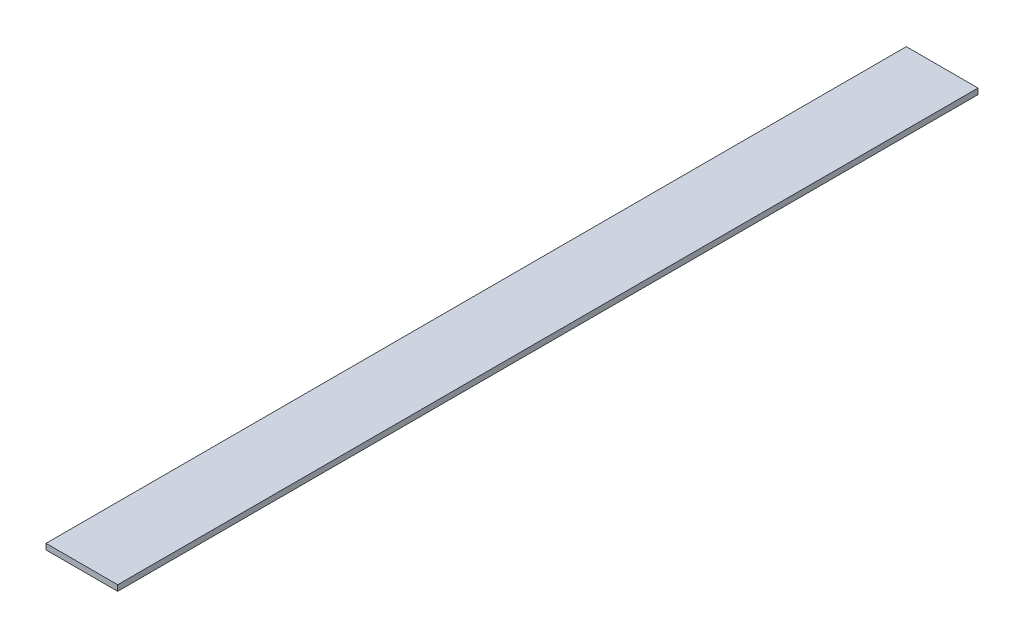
from build123d import *

# Parameters (mm, degrees)
SKETCH1_W           = 50.8
SKETCH1_H           = 609.6
BOSS_EXTRUDE1_DEPTH = 4.064


with BuildPart() as part:
    # Sketch1 → Boss-Extrude1 (new body)
    with BuildSketch(Plane(origin=(0, 0, 0), x_dir=(1, 0, 0), z_dir=(0, 1, 0))):
        Rectangle(SKETCH1_W, SKETCH1_H)
    extrude(amount=BOSS_EXTRUDE1_DEPTH)


solid = part.part
